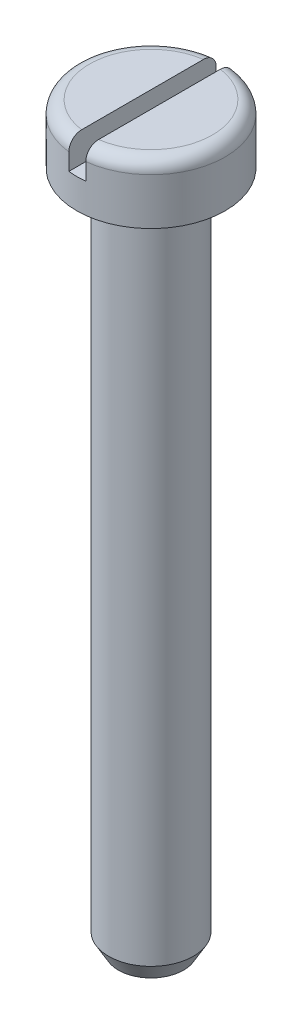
ISO-10303-21;
HEADER;
FILE_DESCRIPTION(('STEP AP214'),'2;1');
FILE_NAME('part.step','',(''),(''),'','','');
FILE_SCHEMA(('AUTOMOTIVE_DESIGN { 1 0 10303 214 1 1 1 1 }'));
ENDSEC;
DATA;
#1=APPLICATION_CONTEXT('core data for automotive mechanical design processes');
#2=APPLICATION_PROTOCOL_DEFINITION('international standard','automotive_design',2000,#1);
#3=PRODUCT_CONTEXT('',#1,'mechanical');
#4=PRODUCT('Part','Part','',(#3));
#5=PRODUCT_RELATED_PRODUCT_CATEGORY('part','',(#4));
#6=PRODUCT_DEFINITION_FORMATION('','',#4);
#7=PRODUCT_DEFINITION_CONTEXT('part definition',#1,'design');
#8=PRODUCT_DEFINITION('design','',#6,#7);
#9=PRODUCT_DEFINITION_SHAPE('','',#8);
#10=(LENGTH_UNIT() NAMED_UNIT(*) SI_UNIT(.MILLI.,.METRE.));
#11=(NAMED_UNIT(*) PLANE_ANGLE_UNIT() SI_UNIT($,.RADIAN.));
#12=(NAMED_UNIT(*) SI_UNIT($,.STERADIAN.) SOLID_ANGLE_UNIT());
#13=UNCERTAINTY_MEASURE_WITH_UNIT(LENGTH_MEASURE(1.E-05),#10,'distance_accuracy_value','');
#14=(GEOMETRIC_REPRESENTATION_CONTEXT(3) GLOBAL_UNCERTAINTY_ASSIGNED_CONTEXT((#13)) GLOBAL_UNIT_ASSIGNED_CONTEXT((#10,
#11,#12)) REPRESENTATION_CONTEXT('',''));
#15=CARTESIAN_POINT('',(0.,0.,0.));
#16=DIRECTION('',(0.,0.,1.));
#17=DIRECTION('',(1.,0.,0.));
#18=AXIS2_PLACEMENT_3D('',#15,#16,#17);
#19=CARTESIAN_POINT('',(0.,1.4,0.));
#20=DIRECTION('',(0.,1.,0.));
#21=DIRECTION('',(0.,0.,1.));
#22=AXIS2_PLACEMENT_3D('',#19,#20,#21);
#23=PLANE('',#22);
#24=DIRECTION('',(0.,0.,-1.));
#25=VECTOR('',#24,1.);
#26=CARTESIAN_POINT('',(0.2,1.4,0.));
#27=LINE('',#26,#25);
#28=CARTESIAN_POINT('',(0.2,1.4,1.43614066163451));
#29=VERTEX_POINT('',#28);
#30=CARTESIAN_POINT('',(0.2,1.4,-1.43614066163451));
#31=VERTEX_POINT('',#30);
#32=EDGE_CURVE('E132',#29,#31,#27,.T.);
#33=ORIENTED_EDGE('',*,*,#32,.F.);
#34=CARTESIAN_POINT('',(0.,1.4,0.));
#35=DIRECTION('',(0.,1.,0.));
#36=DIRECTION('',(0.,0.,1.));
#37=AXIS2_PLACEMENT_3D('',#34,#35,#36);
#38=CIRCLE('',#37,1.45);
#39=EDGE_CURVE('E167',#29,#31,#38,.T.);
#40=ORIENTED_EDGE('',*,*,#39,.T.);
#41=EDGE_LOOP('',(#33,#40));
#42=FACE_BOUND('',#41,.T.);
#43=ADVANCED_FACE('F49',(#42),#23,.T.);
#44=CARTESIAN_POINT('',(0.,1.4,0.));
#45=DIRECTION('',(0.,-1.,0.));
#46=DIRECTION('',(0.,0.,-1.));
#47=AXIS2_PLACEMENT_3D('',#44,#45,#46);
#48=CYLINDRICAL_SURFACE('',#47,1.75);
#49=DIRECTION('',(0.,-1.,0.));
#50=VECTOR('',#49,1.);
#51=CARTESIAN_POINT('',(0.2,1.4,-1.73853386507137));
#52=LINE('',#51,#50);
#53=CARTESIAN_POINT('',(0.2,0.7,-1.73853386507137));
#54=VERTEX_POINT('',#53);
#55=CARTESIAN_POINT('',(0.2,1.1,-1.73853386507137));
#56=VERTEX_POINT('',#55);
#57=EDGE_CURVE('E118',#54,#56,#52,.F.);
#58=ORIENTED_EDGE('',*,*,#57,.T.);
#59=CARTESIAN_POINT('',(0.,1.1,0.));
#60=DIRECTION('',(0.,1.,0.));
#61=DIRECTION('',(0.,0.,1.));
#62=AXIS2_PLACEMENT_3D('',#59,#60,#61);
#63=CIRCLE('',#62,1.75);
#64=CARTESIAN_POINT('',(0.2,1.1,1.73853386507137));
#65=VERTEX_POINT('',#64);
#66=EDGE_CURVE('E230',#56,#65,#63,.F.);
#67=ORIENTED_EDGE('',*,*,#66,.T.);
#68=DIRECTION('',(0.,-1.,0.));
#69=VECTOR('',#68,1.);
#70=CARTESIAN_POINT('',(0.2,1.4,1.73853386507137));
#71=LINE('',#70,#69);
#72=CARTESIAN_POINT('',(0.2,0.7,1.73853386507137));
#73=VERTEX_POINT('',#72);
#74=EDGE_CURVE('E145',#65,#73,#71,.T.);
#75=ORIENTED_EDGE('',*,*,#74,.T.);
#76=CARTESIAN_POINT('',(0.,0.7,0.));
#77=DIRECTION('',(0.,-1.,0.));
#78=DIRECTION('',(0.,0.,-1.));
#79=AXIS2_PLACEMENT_3D('',#76,#77,#78);
#80=CIRCLE('',#79,1.75);
#81=CARTESIAN_POINT('',(-0.2,0.7,1.73853386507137));
#82=VERTEX_POINT('',#81);
#83=EDGE_CURVE('E131',#73,#82,#80,.T.);
#84=ORIENTED_EDGE('',*,*,#83,.T.);
#85=DIRECTION('',(0.,-1.,0.));
#86=VECTOR('',#85,1.);
#87=CARTESIAN_POINT('',(-0.2,1.4,1.73853386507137));
#88=LINE('',#87,#86);
#89=CARTESIAN_POINT('',(-0.2,1.1,1.73853386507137));
#90=VERTEX_POINT('',#89);
#91=EDGE_CURVE('E119',#82,#90,#88,.F.);
#92=ORIENTED_EDGE('',*,*,#91,.T.);
#93=CARTESIAN_POINT('',(0.,1.1,0.));
#94=DIRECTION('',(0.,1.,0.));
#95=DIRECTION('',(0.,0.,1.));
#96=AXIS2_PLACEMENT_3D('',#93,#94,#95);
#97=CIRCLE('',#96,1.75);
#98=CARTESIAN_POINT('',(-0.2,1.1,-1.73853386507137));
#99=VERTEX_POINT('',#98);
#100=EDGE_CURVE('E115',#90,#99,#97,.F.);
#101=ORIENTED_EDGE('',*,*,#100,.T.);
#102=DIRECTION('',(0.,-1.,0.));
#103=VECTOR('',#102,1.);
#104=CARTESIAN_POINT('',(-0.2,1.4,-1.73853386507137));
#105=LINE('',#104,#103);
#106=CARTESIAN_POINT('',(-0.2,0.7,-1.73853386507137));
#107=VERTEX_POINT('',#106);
#108=EDGE_CURVE('E108',#99,#107,#105,.T.);
#109=ORIENTED_EDGE('',*,*,#108,.T.);
#110=EDGE_CURVE('E113',#107,#54,#80,.T.);
#111=ORIENTED_EDGE('',*,*,#110,.T.);
#112=EDGE_LOOP('',(#58,#67,#75,#84,#92,#101,#109,#111));
#113=FACE_BOUND('',#112,.T.);
#114=CARTESIAN_POINT('',(0.,0.,0.));
#115=DIRECTION('',(0.,1.,0.));
#116=DIRECTION('',(0.,0.,1.));
#117=AXIS2_PLACEMENT_3D('',#114,#115,#116);
#118=CIRCLE('',#117,1.75);
#119=CARTESIAN_POINT('',(0.,0.,1.75));
#120=VERTEX_POINT('',#119);
#121=EDGE_CURVE('E148',#120,#120,#118,.T.);
#122=ORIENTED_EDGE('',*,*,#121,.T.);
#123=EDGE_LOOP('',(#122));
#124=FACE_BOUND('',#123,.T.);
#125=ADVANCED_FACE('F111',(#113,#124),#48,.T.);
#126=DIRECTION('',(0.,0.,1.));
#127=VECTOR('',#126,1.);
#128=CARTESIAN_POINT('',(-0.2,1.4,0.));
#129=LINE('',#128,#127);
#130=CARTESIAN_POINT('',(-0.2,1.4,-1.43614066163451));
#131=VERTEX_POINT('',#130);
#132=CARTESIAN_POINT('',(-0.2,1.4,1.43614066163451));
#133=VERTEX_POINT('',#132);
#134=EDGE_CURVE('E152',#131,#133,#129,.T.);
#135=ORIENTED_EDGE('',*,*,#134,.F.);
#136=CARTESIAN_POINT('',(0.,1.4,0.));
#137=DIRECTION('',(0.,1.,0.));
#138=DIRECTION('',(0.,0.,1.));
#139=AXIS2_PLACEMENT_3D('',#136,#137,#138);
#140=CIRCLE('',#139,1.45);
#141=EDGE_CURVE('E234',#131,#133,#140,.T.);
#142=ORIENTED_EDGE('',*,*,#141,.T.);
#143=EDGE_LOOP('',(#135,#142));
#144=FACE_BOUND('',#143,.T.);
#145=ADVANCED_FACE('F195',(#144),#23,.T.);
#146=CARTESIAN_POINT('',(0.,0.,0.));
#147=DIRECTION('',(0.,1.,0.));
#148=DIRECTION('',(0.,0.,1.));
#149=AXIS2_PLACEMENT_3D('',#146,#147,#148);
#150=PLANE('',#149);
#151=CARTESIAN_POINT('',(0.,0.,0.));
#152=DIRECTION('',(0.,-1.,0.));
#153=DIRECTION('',(0.,0.,-1.));
#154=AXIS2_PLACEMENT_3D('',#151,#152,#153);
#155=CIRCLE('',#154,1.);
#156=CARTESIAN_POINT('',(0.,0.,-1.));
#157=VERTEX_POINT('',#156);
#158=EDGE_CURVE('E163',#157,#157,#155,.T.);
#159=ORIENTED_EDGE('',*,*,#158,.F.);
#160=EDGE_LOOP('',(#159));
#161=FACE_BOUND('',#160,.T.);
#162=ORIENTED_EDGE('',*,*,#121,.F.);
#163=EDGE_LOOP('',(#162));
#164=FACE_BOUND('',#163,.T.);
#165=ADVANCED_FACE('F199',(#161,#164),#150,.F.);
#166=CARTESIAN_POINT('',(0.,0.7,0.));
#167=DIRECTION('',(0.,-1.,0.));
#168=DIRECTION('',(0.,0.,-1.));
#169=AXIS2_PLACEMENT_3D('',#166,#167,#168);
#170=PLANE('',#169);
#171=DIRECTION('',(0.,0.,-1.));
#172=VECTOR('',#171,1.);
#173=CARTESIAN_POINT('',(0.2,0.7,2.));
#174=LINE('',#173,#172);
#175=EDGE_CURVE('E129',#73,#54,#174,.T.);
#176=ORIENTED_EDGE('',*,*,#175,.T.);
#177=ORIENTED_EDGE('',*,*,#110,.F.);
#178=DIRECTION('',(0.,0.,1.));
#179=VECTOR('',#178,1.);
#180=CARTESIAN_POINT('',(-0.2,0.7,2.));
#181=LINE('',#180,#179);
#182=EDGE_CURVE('E126',#107,#82,#181,.T.);
#183=ORIENTED_EDGE('',*,*,#182,.T.);
#184=ORIENTED_EDGE('',*,*,#83,.F.);
#185=EDGE_LOOP('',(#176,#177,#183,#184));
#186=FACE_BOUND('',#185,.T.);
#187=ADVANCED_FACE('F124',(#186),#170,.F.);
#188=CARTESIAN_POINT('',(0.2,0.7,2.));
#189=DIRECTION('',(1.,0.,0.));
#190=DIRECTION('',(0.,0.,-1.));
#191=AXIS2_PLACEMENT_3D('',#188,#189,#190);
#192=PLANE('',#191);
#193=ORIENTED_EDGE('',*,*,#32,.T.);
#194=CARTESIAN_POINT('',(0.2,1.4,-1.43614066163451));
#195=CARTESIAN_POINT('',(0.2,1.40001412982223,-1.45326200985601));
#196=CARTESIAN_POINT('',(0.2,1.39856298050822,-1.47038079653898));
#197=CARTESIAN_POINT('',(0.2,1.392826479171,-1.50412881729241));
#198=CARTESIAN_POINT('',(0.2,1.38854246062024,-1.52075827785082));
#199=CARTESIAN_POINT('',(0.2,1.37723278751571,-1.55307057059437));
#200=CARTESIAN_POINT('',(0.2,1.37020537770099,-1.56875278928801));
#201=CARTESIAN_POINT('',(0.2,1.3536060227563,-1.59870195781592));
#202=CARTESIAN_POINT('',(0.2,1.34403478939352,-1.61296930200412));
#203=CARTESIAN_POINT('',(0.2,1.32267009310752,-1.63960341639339));
#204=CARTESIAN_POINT('',(0.2,1.31088889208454,-1.6519800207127));
#205=CARTESIAN_POINT('',(0.2,1.28539863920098,-1.67456389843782));
#206=CARTESIAN_POINT('',(0.2,1.27168922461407,-1.68477076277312));
#207=CARTESIAN_POINT('',(0.2,1.24284529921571,-1.7026423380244));
#208=CARTESIAN_POINT('',(0.2,1.22772206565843,-1.71032527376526));
#209=CARTESIAN_POINT('',(0.2,1.19639886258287,-1.72302206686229));
#210=CARTESIAN_POINT('',(0.2,1.18019964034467,-1.72803775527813));
#211=CARTESIAN_POINT('',(0.2,1.15324159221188,-1.73393598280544));
#212=CARTESIAN_POINT('',(0.2,1.1426592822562,-1.73565920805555));
#213=CARTESIAN_POINT('',(0.2,1.12138619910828,-1.73795791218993));
#214=CARTESIAN_POINT('',(0.2,1.1106956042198,-1.73853504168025));
#215=CARTESIAN_POINT('',(0.2,1.10000000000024,-1.73853386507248));
#216=B_SPLINE_CURVE_WITH_KNOTS('',3,(#194,#195,#196,#197,#198,#199,#200,#201,#202,#203,#204,
#205,#206,#207,#208,#209,#210,#211,#212,#213,#214,#215),.UNSPECIFIED.,.F.,.F.,(4,2,2,2,2,2,2,2,
2,2,4),(0.,0.051299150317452,0.102574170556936,0.153882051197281,0.205175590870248,
0.256192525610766,0.307219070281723,0.357868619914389,0.40848335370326,0.440591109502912,
0.472652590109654),.UNSPECIFIED.);
#217=EDGE_CURVE('E179',#31,#56,#216,.T.);
#218=ORIENTED_EDGE('',*,*,#217,.T.);
#219=ORIENTED_EDGE('',*,*,#57,.F.);
#220=ORIENTED_EDGE('',*,*,#175,.F.);
#221=ORIENTED_EDGE('',*,*,#74,.F.);
#222=CARTESIAN_POINT('',(0.2,1.1,1.73853386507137));
#223=CARTESIAN_POINT('',(0.2,1.11679312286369,1.7385485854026));
#224=CARTESIAN_POINT('',(0.2,1.13358141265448,1.73711542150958));
#225=CARTESIAN_POINT('',(0.2,1.16666641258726,1.73146258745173));
#226=CARTESIAN_POINT('',(0.2,1.18296357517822,1.72724556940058));
#227=CARTESIAN_POINT('',(0.2,1.21462487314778,1.71613154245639));
#228=CARTESIAN_POINT('',(0.2,1.2299886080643,1.70923339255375));
#229=CARTESIAN_POINT('',(0.2,1.25934197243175,1.69296396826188));
#230=CARTESIAN_POINT('',(0.2,1.27333178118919,1.68359301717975));
#231=CARTESIAN_POINT('',(0.2,1.29958375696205,1.66262033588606));
#232=CARTESIAN_POINT('',(0.2,1.31184141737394,1.65101296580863));
#233=CARTESIAN_POINT('',(0.2,1.33425093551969,1.62591424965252));
#234=CARTESIAN_POINT('',(0.2,1.3444023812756,1.61242253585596));
#235=CARTESIAN_POINT('',(0.2,1.36237989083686,1.58384912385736));
#236=CARTESIAN_POINT('',(0.2,1.37019047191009,1.56875769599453));
#237=CARTESIAN_POINT('',(0.2,1.38318598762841,1.5374869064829));
#238=CARTESIAN_POINT('',(0.2,1.38837209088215,1.52130803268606));
#239=CARTESIAN_POINT('',(0.2,1.39477951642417,1.49356064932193));
#240=CARTESIAN_POINT('',(0.2,1.39673651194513,1.48215631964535));
#241=CARTESIAN_POINT('',(0.2,1.39934663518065,1.45921628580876));
#242=CARTESIAN_POINT('',(0.2,1.40000166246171,1.4476807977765));
#243=CARTESIAN_POINT('',(0.2,1.40000000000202,1.43614066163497));
#244=B_SPLINE_CURVE_WITH_KNOTS('',3,(#222,#223,#224,#225,#226,#227,#228,#229,#230,#231,#232,
#233,#234,#235,#236,#237,#238,#239,#240,#241,#242,#243),.UNSPECIFIED.,.F.,.F.,(4,2,2,2,2,2,2,2,
2,2,4),(0.,0.0503112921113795,0.100574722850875,0.150859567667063,0.201137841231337,
0.251544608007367,0.301961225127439,0.35270429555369,0.403424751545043,0.438068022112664,
0.47266071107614),.UNSPECIFIED.);
#245=EDGE_CURVE('E171',#65,#29,#244,.T.);
#246=ORIENTED_EDGE('',*,*,#245,.T.);
#247=EDGE_LOOP('',(#193,#218,#219,#220,#221,#246));
#248=FACE_BOUND('',#247,.T.);
#249=ADVANCED_FACE('F188',(#248),#192,.F.);
#250=CARTESIAN_POINT('',(-0.2,0.7,2.));
#251=DIRECTION('',(-1.,0.,0.));
#252=DIRECTION('',(0.,0.,1.));
#253=AXIS2_PLACEMENT_3D('',#250,#251,#252);
#254=PLANE('',#253);
#255=ORIENTED_EDGE('',*,*,#134,.T.);
#256=CARTESIAN_POINT('',(-0.2,1.4,1.43614066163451));
#257=CARTESIAN_POINT('',(-0.2,1.40001412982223,1.45326200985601));
#258=CARTESIAN_POINT('',(-0.2,1.39856298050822,1.47038079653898));
#259=CARTESIAN_POINT('',(-0.2,1.392826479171,1.50412881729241));
#260=CARTESIAN_POINT('',(-0.2,1.38854246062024,1.52075827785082));
#261=CARTESIAN_POINT('',(-0.2,1.37723278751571,1.55307057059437));
#262=CARTESIAN_POINT('',(-0.2,1.37020537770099,1.56875278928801));
#263=CARTESIAN_POINT('',(-0.2,1.3536060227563,1.59870195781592));
#264=CARTESIAN_POINT('',(-0.2,1.34403478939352,1.61296930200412));
#265=CARTESIAN_POINT('',(-0.2,1.32267009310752,1.63960341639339));
#266=CARTESIAN_POINT('',(-0.2,1.31088889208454,1.6519800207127));
#267=CARTESIAN_POINT('',(-0.2,1.28539863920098,1.67456389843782));
#268=CARTESIAN_POINT('',(-0.2,1.27168922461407,1.68477076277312));
#269=CARTESIAN_POINT('',(-0.2,1.24284529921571,1.7026423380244));
#270=CARTESIAN_POINT('',(-0.2,1.22772206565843,1.71032527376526));
#271=CARTESIAN_POINT('',(-0.2,1.19639886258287,1.72302206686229));
#272=CARTESIAN_POINT('',(-0.2,1.18019964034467,1.72803775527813));
#273=CARTESIAN_POINT('',(-0.2,1.15324159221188,1.73393598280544));
#274=CARTESIAN_POINT('',(-0.2,1.1426592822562,1.73565920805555));
#275=CARTESIAN_POINT('',(-0.2,1.12138619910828,1.73795791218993));
#276=CARTESIAN_POINT('',(-0.2,1.1106956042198,1.73853504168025));
#277=CARTESIAN_POINT('',(-0.2,1.10000000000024,1.73853386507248));
#278=B_SPLINE_CURVE_WITH_KNOTS('',3,(#256,#257,#258,#259,#260,#261,#262,#263,#264,#265,#266,
#267,#268,#269,#270,#271,#272,#273,#274,#275,#276,#277),.UNSPECIFIED.,.F.,.F.,(4,2,2,2,2,2,2,2,
2,2,4),(0.,0.051299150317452,0.102574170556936,0.153882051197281,0.205175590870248,
0.256192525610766,0.307219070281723,0.357868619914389,0.40848335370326,0.440591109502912,
0.472652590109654),.UNSPECIFIED.);
#279=EDGE_CURVE('E11',#133,#90,#278,.T.);
#280=ORIENTED_EDGE('',*,*,#279,.T.);
#281=ORIENTED_EDGE('',*,*,#91,.F.);
#282=ORIENTED_EDGE('',*,*,#182,.F.);
#283=ORIENTED_EDGE('',*,*,#108,.F.);
#284=CARTESIAN_POINT('',(-0.2,1.1,-1.73853386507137));
#285=CARTESIAN_POINT('',(-0.2,1.11679312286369,-1.7385485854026));
#286=CARTESIAN_POINT('',(-0.2,1.13358141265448,-1.73711542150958));
#287=CARTESIAN_POINT('',(-0.2,1.16666641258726,-1.73146258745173));
#288=CARTESIAN_POINT('',(-0.2,1.18296357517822,-1.72724556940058));
#289=CARTESIAN_POINT('',(-0.2,1.21462487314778,-1.71613154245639));
#290=CARTESIAN_POINT('',(-0.2,1.2299886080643,-1.70923339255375));
#291=CARTESIAN_POINT('',(-0.2,1.25934197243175,-1.69296396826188));
#292=CARTESIAN_POINT('',(-0.2,1.27333178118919,-1.68359301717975));
#293=CARTESIAN_POINT('',(-0.2,1.29958375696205,-1.66262033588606));
#294=CARTESIAN_POINT('',(-0.2,1.31184141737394,-1.65101296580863));
#295=CARTESIAN_POINT('',(-0.2,1.33425093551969,-1.62591424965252));
#296=CARTESIAN_POINT('',(-0.2,1.3444023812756,-1.61242253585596));
#297=CARTESIAN_POINT('',(-0.2,1.36237989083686,-1.58384912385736));
#298=CARTESIAN_POINT('',(-0.2,1.37019047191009,-1.56875769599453));
#299=CARTESIAN_POINT('',(-0.2,1.38318598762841,-1.5374869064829));
#300=CARTESIAN_POINT('',(-0.2,1.38837209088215,-1.52130803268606));
#301=CARTESIAN_POINT('',(-0.2,1.39477951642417,-1.49356064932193));
#302=CARTESIAN_POINT('',(-0.2,1.39673651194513,-1.48215631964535));
#303=CARTESIAN_POINT('',(-0.2,1.39934663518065,-1.45921628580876));
#304=CARTESIAN_POINT('',(-0.2,1.40000166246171,-1.4476807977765));
#305=CARTESIAN_POINT('',(-0.2,1.40000000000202,-1.43614066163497));
#306=B_SPLINE_CURVE_WITH_KNOTS('',3,(#284,#285,#286,#287,#288,#289,#290,#291,#292,#293,#294,
#295,#296,#297,#298,#299,#300,#301,#302,#303,#304,#305),.UNSPECIFIED.,.F.,.F.,(4,2,2,2,2,2,2,2,
2,2,4),(0.,0.0503112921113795,0.100574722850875,0.150859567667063,0.201137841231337,
0.251544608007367,0.301961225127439,0.35270429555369,0.403424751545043,0.438068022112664,
0.47266071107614),.UNSPECIFIED.);
#307=EDGE_CURVE('E64',#99,#131,#306,.T.);
#308=ORIENTED_EDGE('',*,*,#307,.T.);
#309=EDGE_LOOP('',(#255,#280,#281,#282,#283,#308));
#310=FACE_BOUND('',#309,.T.);
#311=ADVANCED_FACE('F134',(#310),#254,.F.);
#312=CARTESIAN_POINT('',(0.,-16.,0.));
#313=DIRECTION('',(0.,1.,0.));
#314=DIRECTION('',(0.,0.,1.));
#315=AXIS2_PLACEMENT_3D('',#312,#313,#314);
#316=CYLINDRICAL_SURFACE('',#315,1.);
#317=CARTESIAN_POINT('',(0.,-15.6,0.));
#318=DIRECTION('',(0.,-1.,0.));
#319=DIRECTION('',(0.,0.,-1.));
#320=AXIS2_PLACEMENT_3D('',#317,#318,#319);
#321=CIRCLE('',#320,1.);
#322=CARTESIAN_POINT('',(0.,-15.6,-1.));
#323=VERTEX_POINT('',#322);
#324=EDGE_CURVE('E162',#323,#323,#321,.F.);
#325=ORIENTED_EDGE('',*,*,#324,.T.);
#326=EDGE_LOOP('',(#325));
#327=FACE_BOUND('',#326,.T.);
#328=ORIENTED_EDGE('',*,*,#158,.T.);
#329=EDGE_LOOP('',(#328));
#330=FACE_BOUND('',#329,.T.);
#331=ADVANCED_FACE('F218',(#327,#330),#316,.T.);
#332=CARTESIAN_POINT('',(0.,-16.,0.));
#333=DIRECTION('',(0.,-1.,0.));
#334=DIRECTION('',(0.,0.,-1.));
#335=AXIS2_PLACEMENT_3D('',#332,#333,#334);
#336=PLANE('',#335);
#337=CARTESIAN_POINT('',(0.,-16.,0.));
#338=DIRECTION('',(0.,-1.,0.));
#339=DIRECTION('',(0.,0.,-1.));
#340=AXIS2_PLACEMENT_3D('',#337,#338,#339);
#341=CIRCLE('',#340,0.769059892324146);
#342=CARTESIAN_POINT('',(0.,-16.,-0.769059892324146));
#343=VERTEX_POINT('',#342);
#344=EDGE_CURVE('E158',#343,#343,#341,.T.);
#345=ORIENTED_EDGE('',*,*,#344,.T.);
#346=EDGE_LOOP('',(#345));
#347=FACE_BOUND('',#346,.T.);
#348=ADVANCED_FACE('F210',(#347),#336,.T.);
#349=CARTESIAN_POINT('',(0.,-16.,0.));
#350=DIRECTION('',(0.,1.,0.));
#351=DIRECTION('',(0.,0.,1.));
#352=AXIS2_PLACEMENT_3D('',#349,#350,#351);
#353=CONICAL_SURFACE('',#352,0.769059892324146,0.523598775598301);
#354=ORIENTED_EDGE('',*,*,#324,.F.);
#355=EDGE_LOOP('',(#354));
#356=FACE_BOUND('',#355,.T.);
#357=ORIENTED_EDGE('',*,*,#344,.F.);
#358=EDGE_LOOP('',(#357));
#359=FACE_BOUND('',#358,.T.);
#360=ADVANCED_FACE('F206',(#356,#359),#353,.T.);
#361=CARTESIAN_POINT('',(0.,1.1,0.));
#362=DIRECTION('',(0.,1.,0.));
#363=DIRECTION('',(0.,0.,1.));
#364=AXIS2_PLACEMENT_3D('',#361,#362,#363);
#365=TOROIDAL_SURFACE('',#364,1.45,0.3);
#366=ORIENTED_EDGE('',*,*,#245,.F.);
#367=ORIENTED_EDGE('',*,*,#66,.F.);
#368=ORIENTED_EDGE('',*,*,#217,.F.);
#369=ORIENTED_EDGE('',*,*,#39,.F.);
#370=EDGE_LOOP('',(#366,#367,#368,#369));
#371=FACE_BOUND('',#370,.T.);
#372=ADVANCED_FACE('F185',(#371),#365,.T.);
#373=CARTESIAN_POINT('',(0.,1.1,0.));
#374=DIRECTION('',(0.,1.,0.));
#375=DIRECTION('',(0.,0.,1.));
#376=AXIS2_PLACEMENT_3D('',#373,#374,#375);
#377=TOROIDAL_SURFACE('',#376,1.45,0.3);
#378=ORIENTED_EDGE('',*,*,#307,.F.);
#379=ORIENTED_EDGE('',*,*,#100,.F.);
#380=ORIENTED_EDGE('',*,*,#279,.F.);
#381=ORIENTED_EDGE('',*,*,#141,.F.);
#382=EDGE_LOOP('',(#378,#379,#380,#381));
#383=FACE_BOUND('',#382,.T.);
#384=ADVANCED_FACE('F51',(#383),#377,.T.);
#385=CLOSED_SHELL('',(#43,#125,#145,#165,#187,#249,#311,#331,#348,#360,#372,#384));
#386=MANIFOLD_SOLID_BREP('B2',#385);
#387=ADVANCED_BREP_SHAPE_REPRESENTATION('',(#18,#386),#14);
#388=SHAPE_DEFINITION_REPRESENTATION(#9,#387);
ENDSEC;
END-ISO-10303-21;
